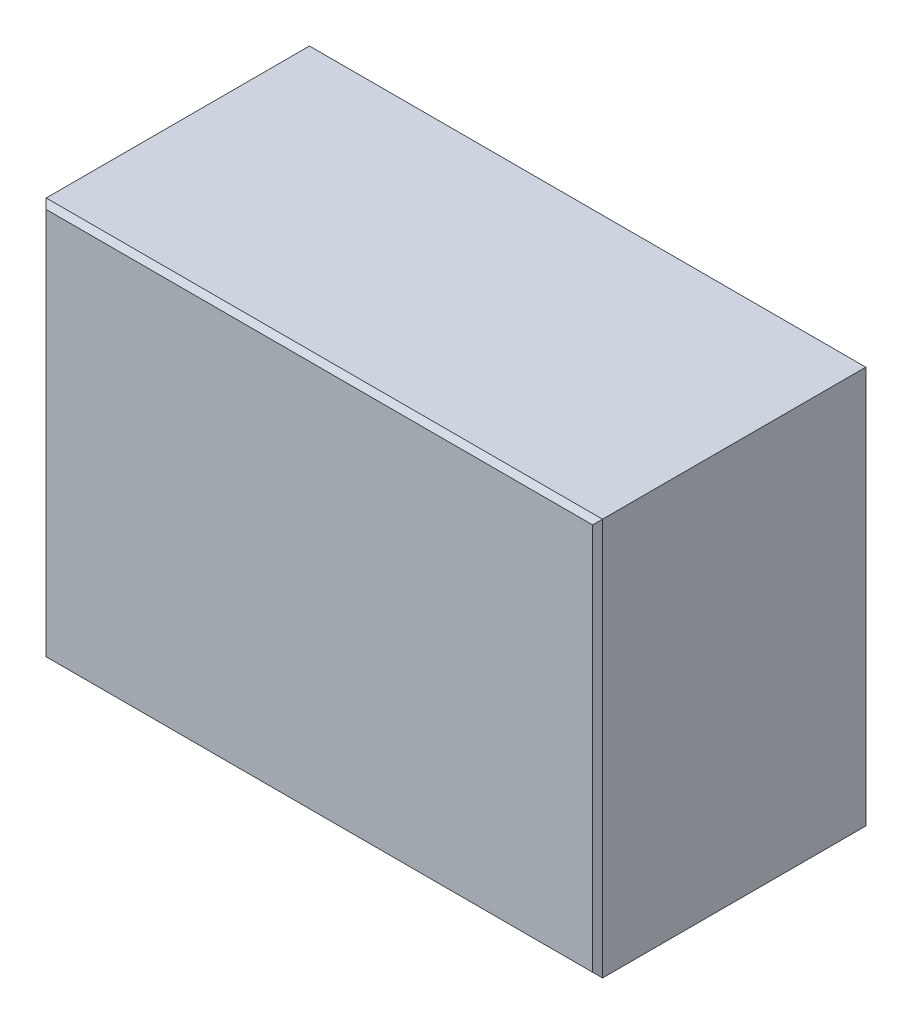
from build123d import *

# Parameters (mm, degrees)
ESQUISSE1_W        = 11.2
ESQUISSE1_H        = 8
BOSS_EXTRU_1_DEPTH = 5.5
CHANFREIN1_SIZE    = 0.1


with BuildPart() as part:
    # Esquisse1 → Boss.-Extru.1 (new body)
    with BuildSketch(Plane.XY):
        Rectangle(ESQUISSE1_W, ESQUISSE1_H)
    extrude(amount=BOSS_EXTRU_1_DEPTH)

    # Chanfrein1
    chanfrein1_edges = [part.edges().sort_by_distance(p)[0] for p in [
        (5.6, 0, 5.5),
        (0, 4, 5.5),
        (-5.6, 0, 5.5),
        (0, 4, 0),
        (5.6, 0, 0),
        (0, -4, 0),
        (-5.6, 0, 0),
        (0, -4, 5.5),
    ]]
    chamfer(chanfrein1_edges, length=CHANFREIN1_SIZE)


solid = part.part
